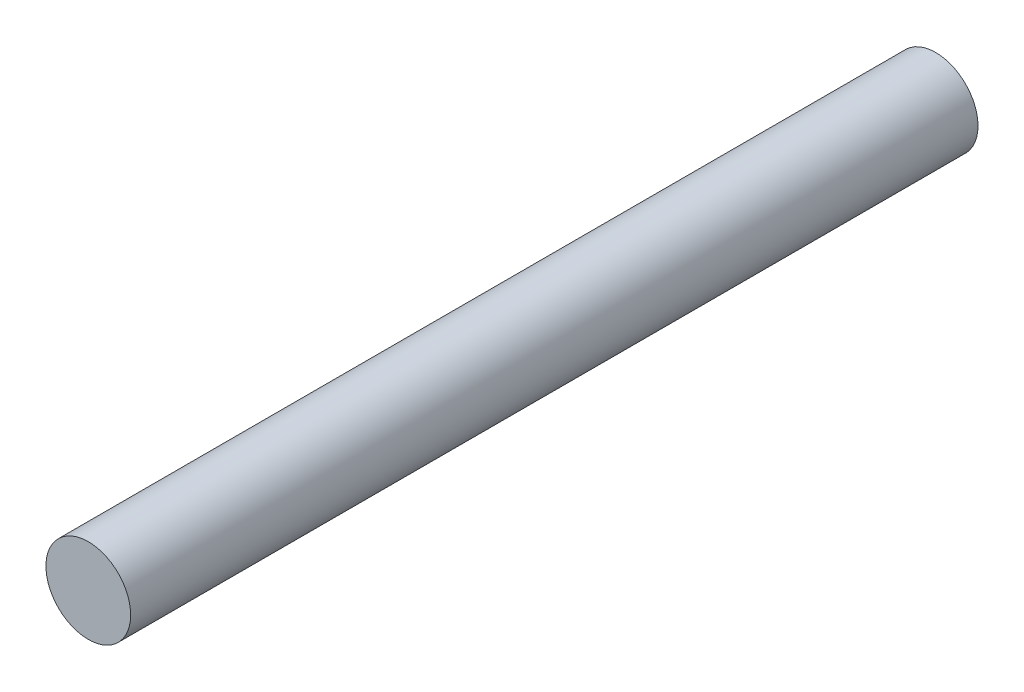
ISO-10303-21;
HEADER;
FILE_DESCRIPTION(('STEP AP214'),'2;1');
FILE_NAME('part.step','',(''),(''),'','','');
FILE_SCHEMA(('AUTOMOTIVE_DESIGN { 1 0 10303 214 1 1 1 1 }'));
ENDSEC;
DATA;
#1=APPLICATION_CONTEXT('core data for automotive mechanical design processes');
#2=APPLICATION_PROTOCOL_DEFINITION('international standard','automotive_design',2000,#1);
#3=PRODUCT_CONTEXT('',#1,'mechanical');
#4=PRODUCT('Part','Part','',(#3));
#5=PRODUCT_RELATED_PRODUCT_CATEGORY('part','',(#4));
#6=PRODUCT_DEFINITION_FORMATION('','',#4);
#7=PRODUCT_DEFINITION_CONTEXT('part definition',#1,'design');
#8=PRODUCT_DEFINITION('design','',#6,#7);
#9=PRODUCT_DEFINITION_SHAPE('','',#8);
#10=(LENGTH_UNIT() NAMED_UNIT(*) SI_UNIT(.MILLI.,.METRE.));
#11=(NAMED_UNIT(*) PLANE_ANGLE_UNIT() SI_UNIT($,.RADIAN.));
#12=(NAMED_UNIT(*) SI_UNIT($,.STERADIAN.) SOLID_ANGLE_UNIT());
#13=UNCERTAINTY_MEASURE_WITH_UNIT(LENGTH_MEASURE(1.E-05),#10,'distance_accuracy_value','');
#14=(GEOMETRIC_REPRESENTATION_CONTEXT(3) GLOBAL_UNCERTAINTY_ASSIGNED_CONTEXT((#13)) GLOBAL_UNIT_ASSIGNED_CONTEXT((#10,
#11,#12)) REPRESENTATION_CONTEXT('',''));
#15=CARTESIAN_POINT('',(0.,0.,0.));
#16=DIRECTION('',(0.,0.,1.));
#17=DIRECTION('',(1.,0.,0.));
#18=AXIS2_PLACEMENT_3D('',#15,#16,#17);
#19=CARTESIAN_POINT('',(0.,0.,500.));
#20=DIRECTION('',(0.,0.,-1.));
#21=DIRECTION('',(-1.,0.,0.));
#22=AXIS2_PLACEMENT_3D('',#19,#20,#21);
#23=CYLINDRICAL_SURFACE('',#22,50.);
#24=CARTESIAN_POINT('',(0.,0.,500.));
#25=DIRECTION('',(0.,0.,1.));
#26=DIRECTION('',(1.,0.,0.));
#27=AXIS2_PLACEMENT_3D('',#24,#25,#26);
#28=CIRCLE('',#27,50.);
#29=CARTESIAN_POINT('',(50.,0.,500.));
#30=VERTEX_POINT('',#29);
#31=EDGE_CURVE('E10',#30,#30,#28,.T.);
#32=ORIENTED_EDGE('',*,*,#31,.F.);
#33=EDGE_LOOP('',(#32));
#34=FACE_BOUND('',#33,.T.);
#35=CARTESIAN_POINT('',(0.,0.,-500.));
#36=DIRECTION('',(0.,0.,1.));
#37=DIRECTION('',(1.,0.,0.));
#38=AXIS2_PLACEMENT_3D('',#35,#36,#37);
#39=CIRCLE('',#38,50.);
#40=CARTESIAN_POINT('',(50.,0.,-500.));
#41=VERTEX_POINT('',#40);
#42=EDGE_CURVE('E36',#41,#41,#39,.T.);
#43=ORIENTED_EDGE('',*,*,#42,.T.);
#44=EDGE_LOOP('',(#43));
#45=FACE_BOUND('',#44,.T.);
#46=ADVANCED_FACE('F33',(#34,#45),#23,.T.);
#47=CARTESIAN_POINT('',(0.,0.,500.));
#48=DIRECTION('',(0.,0.,1.));
#49=DIRECTION('',(1.,0.,0.));
#50=AXIS2_PLACEMENT_3D('',#47,#48,#49);
#51=PLANE('',#50);
#52=ORIENTED_EDGE('',*,*,#31,.T.);
#53=EDGE_LOOP('',(#52));
#54=FACE_BOUND('',#53,.T.);
#55=ADVANCED_FACE('F48',(#54),#51,.T.);
#56=CARTESIAN_POINT('',(0.,0.,-500.));
#57=DIRECTION('',(0.,0.,1.));
#58=DIRECTION('',(1.,0.,0.));
#59=AXIS2_PLACEMENT_3D('',#56,#57,#58);
#60=PLANE('',#59);
#61=ORIENTED_EDGE('',*,*,#42,.F.);
#62=EDGE_LOOP('',(#61));
#63=FACE_BOUND('',#62,.T.);
#64=ADVANCED_FACE('F46',(#63),#60,.F.);
#65=CLOSED_SHELL('',(#46,#55,#64));
#66=MANIFOLD_SOLID_BREP('B2',#65);
#67=ADVANCED_BREP_SHAPE_REPRESENTATION('',(#18,#66),#14);
#68=SHAPE_DEFINITION_REPRESENTATION(#9,#67);
ENDSEC;
END-ISO-10303-21;
